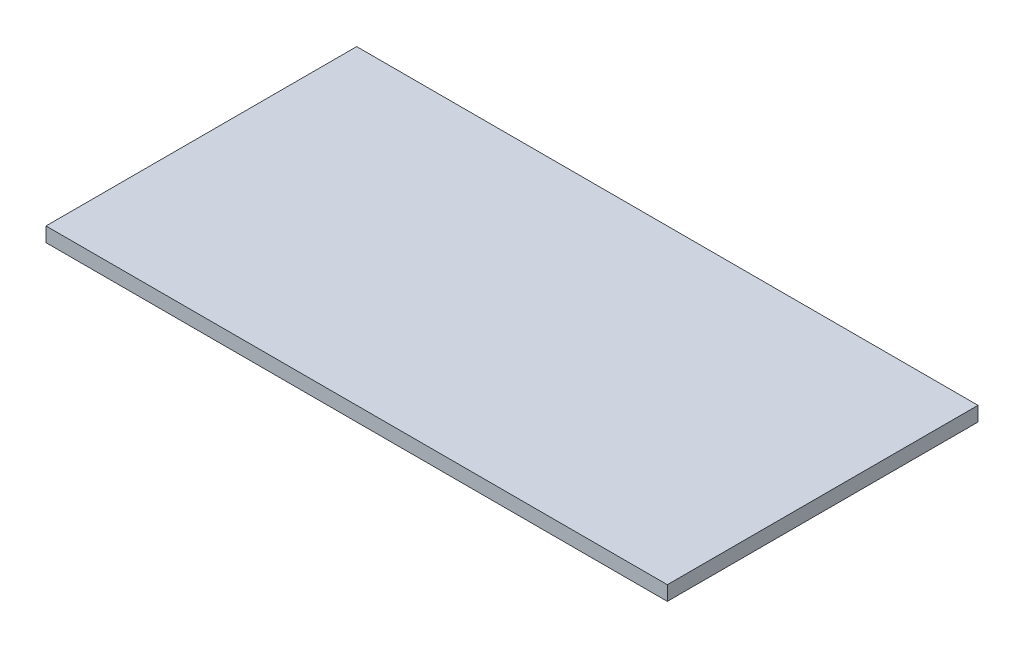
ISO-10303-21;
HEADER;
FILE_DESCRIPTION(('STEP AP214'),'2;1');
FILE_NAME('part.step','',(''),(''),'','','');
FILE_SCHEMA(('AUTOMOTIVE_DESIGN { 1 0 10303 214 1 1 1 1 }'));
ENDSEC;
DATA;
#1=APPLICATION_CONTEXT('core data for automotive mechanical design processes');
#2=APPLICATION_PROTOCOL_DEFINITION('international standard','automotive_design',2000,#1);
#3=PRODUCT_CONTEXT('',#1,'mechanical');
#4=PRODUCT('Part','Part','',(#3));
#5=PRODUCT_RELATED_PRODUCT_CATEGORY('part','',(#4));
#6=PRODUCT_DEFINITION_FORMATION('','',#4);
#7=PRODUCT_DEFINITION_CONTEXT('part definition',#1,'design');
#8=PRODUCT_DEFINITION('design','',#6,#7);
#9=PRODUCT_DEFINITION_SHAPE('','',#8);
#10=(LENGTH_UNIT() NAMED_UNIT(*) SI_UNIT(.MILLI.,.METRE.));
#11=(NAMED_UNIT(*) PLANE_ANGLE_UNIT() SI_UNIT($,.RADIAN.));
#12=(NAMED_UNIT(*) SI_UNIT($,.STERADIAN.) SOLID_ANGLE_UNIT());
#13=UNCERTAINTY_MEASURE_WITH_UNIT(LENGTH_MEASURE(1.E-05),#10,'distance_accuracy_value','');
#14=(GEOMETRIC_REPRESENTATION_CONTEXT(3) GLOBAL_UNCERTAINTY_ASSIGNED_CONTEXT((#13)) GLOBAL_UNIT_ASSIGNED_CONTEXT((#10,
#11,#12)) REPRESENTATION_CONTEXT('',''));
#15=CARTESIAN_POINT('',(0.,0.,0.));
#16=DIRECTION('',(0.,0.,1.));
#17=DIRECTION('',(1.,0.,0.));
#18=AXIS2_PLACEMENT_3D('',#15,#16,#17);
#19=CARTESIAN_POINT('',(560.,0.,-260.));
#20=DIRECTION('',(0.,1.,0.));
#21=DIRECTION('',(0.,0.,-1.));
#22=AXIS2_PLACEMENT_3D('',#19,#20,#21);
#23=CONICAL_SURFACE('',#22,20.,0.78539816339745);
#24=DIRECTION('',(0.,0.707106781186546,-0.707106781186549));
#25=VECTOR('',#24,1.);
#26=CARTESIAN_POINT('',(560.,0.,-280.));
#27=LINE('',#26,#25);
#28=CARTESIAN_POINT('',(560.,-4.41421356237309,-275.585786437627));
#29=VERTEX_POINT('',#28);
#30=CARTESIAN_POINT('',(560.,-0.585786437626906,-279.414213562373));
#31=VERTEX_POINT('',#30);
#32=EDGE_CURVE('E199',#29,#31,#27,.T.);
#33=ORIENTED_EDGE('',*,*,#32,.T.);
#34=CARTESIAN_POINT('',(560.,-0.585786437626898,-260.));
#35=DIRECTION('',(0.,-1.,0.));
#36=DIRECTION('',(0.,0.,-1.));
#37=AXIS2_PLACEMENT_3D('',#34,#35,#36);
#38=CIRCLE('',#37,19.4142135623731);
#39=CARTESIAN_POINT('',(579.414213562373,-0.585786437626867,-260.));
#40=VERTEX_POINT('',#39);
#41=EDGE_CURVE('E265',#31,#40,#38,.T.);
#42=ORIENTED_EDGE('',*,*,#41,.T.);
#43=DIRECTION('',(0.707106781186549,0.707106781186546,0.));
#44=VECTOR('',#43,1.);
#45=CARTESIAN_POINT('',(580.,0.,-260.));
#46=LINE('',#45,#44);
#47=CARTESIAN_POINT('',(575.585786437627,-4.41421356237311,-260.));
#48=VERTEX_POINT('',#47);
#49=EDGE_CURVE('E208',#48,#40,#46,.T.);
#50=ORIENTED_EDGE('',*,*,#49,.F.);
#51=CARTESIAN_POINT('',(560.,-4.4142135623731,-260.));
#52=DIRECTION('',(0.,-1.,0.));
#53=DIRECTION('',(0.,0.,-1.));
#54=AXIS2_PLACEMENT_3D('',#51,#52,#53);
#55=CIRCLE('',#54,15.5857864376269);
#56=EDGE_CURVE('E263',#48,#29,#55,.F.);
#57=ORIENTED_EDGE('',*,*,#56,.T.);
#58=EDGE_LOOP('',(#33,#42,#50,#57));
#59=FACE_BOUND('',#58,.T.);
#60=ADVANCED_FACE('F36',(#59),#23,.T.);
#61=CARTESIAN_POINT('',(580.,0.,-260.));
#62=DIRECTION('',(0.707106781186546,-0.707106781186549,0.));
#63=DIRECTION('',(0.707106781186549,0.707106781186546,0.));
#64=AXIS2_PLACEMENT_3D('',#61,#62,#63);
#65=PLANE('',#64);
#66=ORIENTED_EDGE('',*,*,#49,.T.);
#67=DIRECTION('',(0.,0.,-1.));
#68=VECTOR('',#67,1.);
#69=CARTESIAN_POINT('',(579.414213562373,-0.585786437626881,-260.));
#70=LINE('',#69,#68);
#71=CARTESIAN_POINT('',(579.414213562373,-0.585786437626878,260.));
#72=VERTEX_POINT('',#71);
#73=EDGE_CURVE('E269',#40,#72,#70,.F.);
#74=ORIENTED_EDGE('',*,*,#73,.T.);
#75=DIRECTION('',(0.707106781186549,0.707106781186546,0.));
#76=VECTOR('',#75,1.);
#77=CARTESIAN_POINT('',(580.,0.,260.));
#78=LINE('',#77,#76);
#79=CARTESIAN_POINT('',(575.585786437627,-4.41421356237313,260.));
#80=VERTEX_POINT('',#79);
#81=EDGE_CURVE('E211',#80,#72,#78,.T.);
#82=ORIENTED_EDGE('',*,*,#81,.F.);
#83=DIRECTION('',(0.,0.,-1.));
#84=VECTOR('',#83,1.);
#85=CARTESIAN_POINT('',(575.585786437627,-4.41421356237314,-260.));
#86=LINE('',#85,#84);
#87=EDGE_CURVE('E267',#80,#48,#86,.T.);
#88=ORIENTED_EDGE('',*,*,#87,.T.);
#89=EDGE_LOOP('',(#66,#74,#82,#88));
#90=FACE_BOUND('',#89,.T.);
#91=ADVANCED_FACE('F386',(#90),#65,.T.);
#92=CARTESIAN_POINT('',(560.,0.,260.));
#93=DIRECTION('',(0.,1.,0.));
#94=DIRECTION('',(0.,0.,1.));
#95=AXIS2_PLACEMENT_3D('',#92,#93,#94);
#96=CONICAL_SURFACE('',#95,20.,0.78539816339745);
#97=ORIENTED_EDGE('',*,*,#81,.T.);
#98=CARTESIAN_POINT('',(560.,-0.585786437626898,260.));
#99=DIRECTION('',(0.,-1.,0.));
#100=DIRECTION('',(0.,0.,-1.));
#101=AXIS2_PLACEMENT_3D('',#98,#99,#100);
#102=CIRCLE('',#101,19.4142135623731);
#103=CARTESIAN_POINT('',(560.,-0.585786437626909,279.414213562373));
#104=VERTEX_POINT('',#103);
#105=EDGE_CURVE('E273',#72,#104,#102,.T.);
#106=ORIENTED_EDGE('',*,*,#105,.T.);
#107=DIRECTION('',(0.,0.707106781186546,0.707106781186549));
#108=VECTOR('',#107,1.);
#109=CARTESIAN_POINT('',(560.,0.,280.));
#110=LINE('',#109,#108);
#111=CARTESIAN_POINT('',(560.,-4.41421356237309,275.585786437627));
#112=VERTEX_POINT('',#111);
#113=EDGE_CURVE('E224',#112,#104,#110,.T.);
#114=ORIENTED_EDGE('',*,*,#113,.F.);
#115=CARTESIAN_POINT('',(560.,-4.4142135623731,260.));
#116=DIRECTION('',(0.,-1.,0.));
#117=DIRECTION('',(0.,0.,-1.));
#118=AXIS2_PLACEMENT_3D('',#115,#116,#117);
#119=CIRCLE('',#118,15.5857864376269);
#120=EDGE_CURVE('E271',#112,#80,#119,.F.);
#121=ORIENTED_EDGE('',*,*,#120,.T.);
#122=EDGE_LOOP('',(#97,#106,#114,#121));
#123=FACE_BOUND('',#122,.T.);
#124=ADVANCED_FACE('F390',(#123),#96,.T.);
#125=CARTESIAN_POINT('',(-560.,0.,280.));
#126=DIRECTION('',(0.,-0.707106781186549,0.707106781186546));
#127=DIRECTION('',(0.,-0.707106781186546,-0.707106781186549));
#128=AXIS2_PLACEMENT_3D('',#125,#126,#127);
#129=PLANE('',#128);
#130=DIRECTION('',(0.,0.707106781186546,0.707106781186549));
#131=VECTOR('',#130,1.);
#132=CARTESIAN_POINT('',(-560.,0.,280.));
#133=LINE('',#132,#131);
#134=CARTESIAN_POINT('',(-560.,-4.41421356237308,275.585786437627));
#135=VERTEX_POINT('',#134);
#136=CARTESIAN_POINT('',(-560.,-0.585786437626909,279.414213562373));
#137=VERTEX_POINT('',#136);
#138=EDGE_CURVE('E221',#135,#137,#133,.T.);
#139=ORIENTED_EDGE('',*,*,#138,.F.);
#140=DIRECTION('',(1.,0.,0.));
#141=VECTOR('',#140,1.);
#142=CARTESIAN_POINT('',(-560.,-4.41421356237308,275.585786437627));
#143=LINE('',#142,#141);
#144=EDGE_CURVE('E12',#135,#112,#143,.T.);
#145=ORIENTED_EDGE('',*,*,#144,.T.);
#146=ORIENTED_EDGE('',*,*,#113,.T.);
#147=DIRECTION('',(1.,0.,0.));
#148=VECTOR('',#147,1.);
#149=CARTESIAN_POINT('',(-560.,-0.585786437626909,279.414213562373));
#150=LINE('',#149,#148);
#151=EDGE_CURVE('E45',#104,#137,#150,.F.);
#152=ORIENTED_EDGE('',*,*,#151,.T.);
#153=EDGE_LOOP('',(#139,#145,#146,#152));
#154=FACE_BOUND('',#153,.T.);
#155=ADVANCED_FACE('F406',(#154),#129,.T.);
#156=CARTESIAN_POINT('',(-560.,0.,260.));
#157=DIRECTION('',(0.,1.,0.));
#158=DIRECTION('',(0.,0.,1.));
#159=AXIS2_PLACEMENT_3D('',#156,#157,#158);
#160=CONICAL_SURFACE('',#159,20.,0.78539816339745);
#161=ORIENTED_EDGE('',*,*,#138,.T.);
#162=CARTESIAN_POINT('',(-560.,-0.585786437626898,260.));
#163=DIRECTION('',(0.,-1.,0.));
#164=DIRECTION('',(0.,0.,-1.));
#165=AXIS2_PLACEMENT_3D('',#162,#163,#164);
#166=CIRCLE('',#165,19.4142135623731);
#167=CARTESIAN_POINT('',(-579.414213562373,-0.585786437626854,260.));
#168=VERTEX_POINT('',#167);
#169=EDGE_CURVE('E247',#137,#168,#166,.T.);
#170=ORIENTED_EDGE('',*,*,#169,.T.);
#171=DIRECTION('',(-0.707106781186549,0.707106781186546,0.));
#172=VECTOR('',#171,1.);
#173=CARTESIAN_POINT('',(-580.,0.,260.));
#174=LINE('',#173,#172);
#175=CARTESIAN_POINT('',(-575.585786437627,-4.41421356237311,260.));
#176=VERTEX_POINT('',#175);
#177=EDGE_CURVE('E218',#176,#168,#174,.T.);
#178=ORIENTED_EDGE('',*,*,#177,.F.);
#179=CARTESIAN_POINT('',(-560.,-4.4142135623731,260.));
#180=DIRECTION('',(0.,-1.,0.));
#181=DIRECTION('',(0.,0.,-1.));
#182=AXIS2_PLACEMENT_3D('',#179,#180,#181);
#183=CIRCLE('',#182,15.5857864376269);
#184=EDGE_CURVE('E245',#176,#135,#183,.F.);
#185=ORIENTED_EDGE('',*,*,#184,.T.);
#186=EDGE_LOOP('',(#161,#170,#178,#185));
#187=FACE_BOUND('',#186,.T.);
#188=ADVANCED_FACE('F409',(#187),#160,.T.);
#189=CARTESIAN_POINT('',(-580.,0.,-260.));
#190=DIRECTION('',(-0.707106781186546,-0.707106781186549,0.));
#191=DIRECTION('',(0.707106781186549,-0.707106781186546,0.));
#192=AXIS2_PLACEMENT_3D('',#189,#190,#191);
#193=PLANE('',#192);
#194=ORIENTED_EDGE('',*,*,#177,.T.);
#195=DIRECTION('',(0.,0.,1.));
#196=VECTOR('',#195,1.);
#197=CARTESIAN_POINT('',(-579.414213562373,-0.585786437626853,-260.));
#198=LINE('',#197,#196);
#199=CARTESIAN_POINT('',(-579.414213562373,-0.585786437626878,-260.));
#200=VERTEX_POINT('',#199);
#201=EDGE_CURVE('E252',#168,#200,#198,.F.);
#202=ORIENTED_EDGE('',*,*,#201,.T.);
#203=DIRECTION('',(-0.707106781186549,0.707106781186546,0.));
#204=VECTOR('',#203,1.);
#205=CARTESIAN_POINT('',(-580.,0.,-260.));
#206=LINE('',#205,#204);
#207=CARTESIAN_POINT('',(-575.585786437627,-4.41421356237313,-260.));
#208=VERTEX_POINT('',#207);
#209=EDGE_CURVE('E215',#208,#200,#206,.T.);
#210=ORIENTED_EDGE('',*,*,#209,.F.);
#211=DIRECTION('',(0.,0.,1.));
#212=VECTOR('',#211,1.);
#213=CARTESIAN_POINT('',(-575.585786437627,-4.41421356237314,-260.));
#214=LINE('',#213,#212);
#215=EDGE_CURVE('E250',#208,#176,#214,.T.);
#216=ORIENTED_EDGE('',*,*,#215,.T.);
#217=EDGE_LOOP('',(#194,#202,#210,#216));
#218=FACE_BOUND('',#217,.T.);
#219=ADVANCED_FACE('F419',(#218),#193,.T.);
#220=CARTESIAN_POINT('',(-560.,0.,-260.));
#221=DIRECTION('',(0.,1.,0.));
#222=DIRECTION('',(0.,0.,1.));
#223=AXIS2_PLACEMENT_3D('',#220,#221,#222);
#224=CONICAL_SURFACE('',#223,20.,0.78539816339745);
#225=ORIENTED_EDGE('',*,*,#209,.T.);
#226=CARTESIAN_POINT('',(-560.,-0.585786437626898,-260.));
#227=DIRECTION('',(0.,-1.,0.));
#228=DIRECTION('',(0.,0.,-1.));
#229=AXIS2_PLACEMENT_3D('',#226,#227,#228);
#230=CIRCLE('',#229,19.4142135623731);
#231=CARTESIAN_POINT('',(-560.,-0.58578643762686,-279.414213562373));
#232=VERTEX_POINT('',#231);
#233=EDGE_CURVE('E256',#200,#232,#230,.T.);
#234=ORIENTED_EDGE('',*,*,#233,.T.);
#235=DIRECTION('',(0.,0.707106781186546,-0.707106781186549));
#236=VECTOR('',#235,1.);
#237=CARTESIAN_POINT('',(-560.,0.,-280.));
#238=LINE('',#237,#236);
#239=CARTESIAN_POINT('',(-560.,-4.41421356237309,-275.585786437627));
#240=VERTEX_POINT('',#239);
#241=EDGE_CURVE('E202',#240,#232,#238,.T.);
#242=ORIENTED_EDGE('',*,*,#241,.F.);
#243=CARTESIAN_POINT('',(-560.,-4.4142135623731,-260.));
#244=DIRECTION('',(0.,-1.,0.));
#245=DIRECTION('',(0.,0.,-1.));
#246=AXIS2_PLACEMENT_3D('',#243,#244,#245);
#247=CIRCLE('',#246,15.5857864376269);
#248=EDGE_CURVE('E254',#240,#208,#247,.F.);
#249=ORIENTED_EDGE('',*,*,#248,.T.);
#250=EDGE_LOOP('',(#225,#234,#242,#249));
#251=FACE_BOUND('',#250,.T.);
#252=ADVANCED_FACE('F422',(#251),#224,.T.);
#253=CARTESIAN_POINT('',(-560.,0.,-280.));
#254=DIRECTION('',(0.,-0.707106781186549,-0.707106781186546));
#255=DIRECTION('',(0.,0.707106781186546,-0.707106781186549));
#256=AXIS2_PLACEMENT_3D('',#253,#254,#255);
#257=PLANE('',#256);
#258=ORIENTED_EDGE('',*,*,#241,.T.);
#259=DIRECTION('',(-1.,0.,0.));
#260=VECTOR('',#259,1.);
#261=CARTESIAN_POINT('',(-560.,-0.585786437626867,-279.414213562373));
#262=LINE('',#261,#260);
#263=EDGE_CURVE('E261',#232,#31,#262,.F.);
#264=ORIENTED_EDGE('',*,*,#263,.T.);
#265=ORIENTED_EDGE('',*,*,#32,.F.);
#266=DIRECTION('',(-1.,0.,0.));
#267=VECTOR('',#266,1.);
#268=CARTESIAN_POINT('',(-560.,-4.41421356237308,-275.585786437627));
#269=LINE('',#268,#267);
#270=EDGE_CURVE('E258',#29,#240,#269,.T.);
#271=ORIENTED_EDGE('',*,*,#270,.T.);
#272=EDGE_LOOP('',(#258,#264,#265,#271));
#273=FACE_BOUND('',#272,.T.);
#274=ADVANCED_FACE('F361',(#273),#257,.T.);
#275=CARTESIAN_POINT('',(560.,-5.,-260.));
#276=DIRECTION('',(0.,-1.,0.));
#277=DIRECTION('',(0.,0.,-1.));
#278=AXIS2_PLACEMENT_3D('',#275,#276,#277);
#279=PLANE('',#278);
#280=CARTESIAN_POINT('',(-560.,-5.,-260.));
#281=DIRECTION('',(0.,-1.,0.));
#282=DIRECTION('',(0.,0.,-1.));
#283=AXIS2_PLACEMENT_3D('',#280,#281,#282);
#284=CIRCLE('',#283,14.1715728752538);
#285=CARTESIAN_POINT('',(-574.171572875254,-5.,-260.));
#286=VERTEX_POINT('',#285);
#287=CARTESIAN_POINT('',(-560.,-5.,-274.171572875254));
#288=VERTEX_POINT('',#287);
#289=EDGE_CURVE('E53',#286,#288,#284,.T.);
#290=ORIENTED_EDGE('',*,*,#289,.T.);
#291=DIRECTION('',(-1.,0.,0.));
#292=VECTOR('',#291,1.);
#293=CARTESIAN_POINT('',(560.,-5.,-274.171572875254));
#294=LINE('',#293,#292);
#295=CARTESIAN_POINT('',(560.,-5.,-274.171572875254));
#296=VERTEX_POINT('',#295);
#297=EDGE_CURVE('E287',#288,#296,#294,.F.);
#298=ORIENTED_EDGE('',*,*,#297,.T.);
#299=CARTESIAN_POINT('',(560.,-5.,-260.));
#300=DIRECTION('',(0.,-1.,0.));
#301=DIRECTION('',(0.,0.,-1.));
#302=AXIS2_PLACEMENT_3D('',#299,#300,#301);
#303=CIRCLE('',#302,14.1715728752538);
#304=CARTESIAN_POINT('',(574.171572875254,-5.,-260.));
#305=VERTEX_POINT('',#304);
#306=EDGE_CURVE('E275',#296,#305,#303,.T.);
#307=ORIENTED_EDGE('',*,*,#306,.T.);
#308=DIRECTION('',(0.,0.,-1.));
#309=VECTOR('',#308,1.);
#310=CARTESIAN_POINT('',(574.171572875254,-5.,-260.));
#311=LINE('',#310,#309);
#312=CARTESIAN_POINT('',(574.171572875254,-5.,260.));
#313=VERTEX_POINT('',#312);
#314=EDGE_CURVE('E277',#305,#313,#311,.F.);
#315=ORIENTED_EDGE('',*,*,#314,.T.);
#316=CARTESIAN_POINT('',(560.,-5.,260.));
#317=DIRECTION('',(0.,-1.,0.));
#318=DIRECTION('',(0.,0.,-1.));
#319=AXIS2_PLACEMENT_3D('',#316,#317,#318);
#320=CIRCLE('',#319,14.1715728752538);
#321=CARTESIAN_POINT('',(560.,-5.,274.171572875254));
#322=VERTEX_POINT('',#321);
#323=EDGE_CURVE('E279',#313,#322,#320,.T.);
#324=ORIENTED_EDGE('',*,*,#323,.T.);
#325=DIRECTION('',(1.,0.,0.));
#326=VECTOR('',#325,1.);
#327=CARTESIAN_POINT('',(560.,-5.,274.171572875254));
#328=LINE('',#327,#326);
#329=CARTESIAN_POINT('',(-560.,-5.,274.171572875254));
#330=VERTEX_POINT('',#329);
#331=EDGE_CURVE('E281',#322,#330,#328,.F.);
#332=ORIENTED_EDGE('',*,*,#331,.T.);
#333=CARTESIAN_POINT('',(-560.,-5.,260.));
#334=DIRECTION('',(0.,-1.,0.));
#335=DIRECTION('',(0.,0.,-1.));
#336=AXIS2_PLACEMENT_3D('',#333,#334,#335);
#337=CIRCLE('',#336,14.1715728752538);
#338=CARTESIAN_POINT('',(-574.171572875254,-5.,260.));
#339=VERTEX_POINT('',#338);
#340=EDGE_CURVE('E283',#330,#339,#337,.T.);
#341=ORIENTED_EDGE('',*,*,#340,.T.);
#342=DIRECTION('',(0.,0.,1.));
#343=VECTOR('',#342,1.);
#344=CARTESIAN_POINT('',(-574.171572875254,-5.,-260.));
#345=LINE('',#344,#343);
#346=EDGE_CURVE('E58',#339,#286,#345,.F.);
#347=ORIENTED_EDGE('',*,*,#346,.T.);
#348=EDGE_LOOP('',(#290,#298,#307,#315,#324,#332,#341,#347));
#349=FACE_BOUND('',#348,.T.);
#350=ADVANCED_FACE('F343',(#349),#279,.T.);
#351=CARTESIAN_POINT('',(600.,28.,-300.));
#352=DIRECTION('',(-1.,0.,0.));
#353=DIRECTION('',(0.,0.,1.));
#354=AXIS2_PLACEMENT_3D('',#351,#352,#353);
#355=PLANE('',#354);
#356=DIRECTION('',(0.,0.,-1.));
#357=VECTOR('',#356,1.);
#358=CARTESIAN_POINT('',(600.,0.,-300.));
#359=LINE('',#358,#357);
#360=CARTESIAN_POINT('',(600.,0.,300.));
#361=VERTEX_POINT('',#360);
#362=CARTESIAN_POINT('',(600.,0.,-300.));
#363=VERTEX_POINT('',#362);
#364=EDGE_CURVE('E198',#361,#363,#359,.T.);
#365=ORIENTED_EDGE('',*,*,#364,.T.);
#366=DIRECTION('',(0.,-1.,0.));
#367=VECTOR('',#366,1.);
#368=CARTESIAN_POINT('',(600.,28.,-300.));
#369=LINE('',#368,#367);
#370=CARTESIAN_POINT('',(600.,28.,-300.));
#371=VERTEX_POINT('',#370);
#372=EDGE_CURVE('E178',#371,#363,#369,.T.);
#373=ORIENTED_EDGE('',*,*,#372,.F.);
#374=DIRECTION('',(0.,0.,-1.));
#375=VECTOR('',#374,1.);
#376=CARTESIAN_POINT('',(600.,28.,-300.));
#377=LINE('',#376,#375);
#378=CARTESIAN_POINT('',(600.,28.,300.));
#379=VERTEX_POINT('',#378);
#380=EDGE_CURVE('E185',#379,#371,#377,.T.);
#381=ORIENTED_EDGE('',*,*,#380,.F.);
#382=DIRECTION('',(0.,-1.,0.));
#383=VECTOR('',#382,1.);
#384=CARTESIAN_POINT('',(600.,28.,300.));
#385=LINE('',#384,#383);
#386=EDGE_CURVE('E746',#379,#361,#385,.T.);
#387=ORIENTED_EDGE('',*,*,#386,.T.);
#388=EDGE_LOOP('',(#365,#373,#381,#387));
#389=FACE_BOUND('',#388,.T.);
#390=ADVANCED_FACE('F196',(#389),#355,.F.);
#391=CARTESIAN_POINT('',(-600.,28.,-300.));
#392=DIRECTION('',(0.,0.,1.));
#393=DIRECTION('',(1.,0.,0.));
#394=AXIS2_PLACEMENT_3D('',#391,#392,#393);
#395=PLANE('',#394);
#396=DIRECTION('',(-1.,0.,0.));
#397=VECTOR('',#396,1.);
#398=CARTESIAN_POINT('',(-600.,0.,-300.));
#399=LINE('',#398,#397);
#400=CARTESIAN_POINT('',(-600.,0.,-300.));
#401=VERTEX_POINT('',#400);
#402=EDGE_CURVE('E752',#363,#401,#399,.T.);
#403=ORIENTED_EDGE('',*,*,#402,.T.);
#404=DIRECTION('',(0.,-1.,0.));
#405=VECTOR('',#404,1.);
#406=CARTESIAN_POINT('',(-600.,28.,-300.));
#407=LINE('',#406,#405);
#408=CARTESIAN_POINT('',(-600.,28.,-300.));
#409=VERTEX_POINT('',#408);
#410=EDGE_CURVE('E181',#409,#401,#407,.T.);
#411=ORIENTED_EDGE('',*,*,#410,.F.);
#412=DIRECTION('',(-1.,0.,0.));
#413=VECTOR('',#412,1.);
#414=CARTESIAN_POINT('',(-600.,28.,-300.));
#415=LINE('',#414,#413);
#416=EDGE_CURVE('E174',#371,#409,#415,.T.);
#417=ORIENTED_EDGE('',*,*,#416,.F.);
#418=ORIENTED_EDGE('',*,*,#372,.T.);
#419=EDGE_LOOP('',(#403,#411,#417,#418));
#420=FACE_BOUND('',#419,.T.);
#421=ADVANCED_FACE('F176',(#420),#395,.F.);
#422=CARTESIAN_POINT('',(-600.,28.,-300.));
#423=DIRECTION('',(1.,0.,0.));
#424=DIRECTION('',(0.,0.,-1.));
#425=AXIS2_PLACEMENT_3D('',#422,#423,#424);
#426=PLANE('',#425);
#427=DIRECTION('',(0.,0.,1.));
#428=VECTOR('',#427,1.);
#429=CARTESIAN_POINT('',(-600.,0.,-300.));
#430=LINE('',#429,#428);
#431=CARTESIAN_POINT('',(-600.,0.,300.));
#432=VERTEX_POINT('',#431);
#433=EDGE_CURVE('E749',#401,#432,#430,.T.);
#434=ORIENTED_EDGE('',*,*,#433,.T.);
#435=DIRECTION('',(0.,-1.,0.));
#436=VECTOR('',#435,1.);
#437=CARTESIAN_POINT('',(-600.,28.,300.));
#438=LINE('',#437,#436);
#439=CARTESIAN_POINT('',(-600.,28.,300.));
#440=VERTEX_POINT('',#439);
#441=EDGE_CURVE('E204',#440,#432,#438,.T.);
#442=ORIENTED_EDGE('',*,*,#441,.F.);
#443=DIRECTION('',(0.,0.,1.));
#444=VECTOR('',#443,1.);
#445=CARTESIAN_POINT('',(-600.,28.,-300.));
#446=LINE('',#445,#444);
#447=EDGE_CURVE('E184',#409,#440,#446,.T.);
#448=ORIENTED_EDGE('',*,*,#447,.F.);
#449=ORIENTED_EDGE('',*,*,#410,.T.);
#450=EDGE_LOOP('',(#434,#442,#448,#449));
#451=FACE_BOUND('',#450,.T.);
#452=ADVANCED_FACE('F516',(#451),#426,.F.);
#453=CARTESIAN_POINT('',(-600.,28.,300.));
#454=DIRECTION('',(0.,0.,-1.));
#455=DIRECTION('',(-1.,0.,0.));
#456=AXIS2_PLACEMENT_3D('',#453,#454,#455);
#457=PLANE('',#456);
#458=DIRECTION('',(1.,0.,0.));
#459=VECTOR('',#458,1.);
#460=CARTESIAN_POINT('',(-600.,0.,300.));
#461=LINE('',#460,#459);
#462=EDGE_CURVE('E194',#432,#361,#461,.T.);
#463=ORIENTED_EDGE('',*,*,#462,.T.);
#464=ORIENTED_EDGE('',*,*,#386,.F.);
#465=DIRECTION('',(1.,0.,0.));
#466=VECTOR('',#465,1.);
#467=CARTESIAN_POINT('',(-600.,28.,300.));
#468=LINE('',#467,#466);
#469=EDGE_CURVE('E190',#440,#379,#468,.T.);
#470=ORIENTED_EDGE('',*,*,#469,.F.);
#471=ORIENTED_EDGE('',*,*,#441,.T.);
#472=EDGE_LOOP('',(#463,#464,#470,#471));
#473=FACE_BOUND('',#472,.T.);
#474=ADVANCED_FACE('F525',(#473),#457,.F.);
#475=CARTESIAN_POINT('',(0.,28.,0.));
#476=DIRECTION('',(0.,1.,0.));
#477=DIRECTION('',(0.,0.,1.));
#478=AXIS2_PLACEMENT_3D('',#475,#476,#477);
#479=PLANE('',#478);
#480=ORIENTED_EDGE('',*,*,#380,.T.);
#481=ORIENTED_EDGE('',*,*,#416,.T.);
#482=ORIENTED_EDGE('',*,*,#447,.T.);
#483=ORIENTED_EDGE('',*,*,#469,.T.);
#484=EDGE_LOOP('',(#480,#481,#482,#483));
#485=FACE_BOUND('',#484,.T.);
#486=ADVANCED_FACE('F188',(#485),#479,.T.);
#487=CARTESIAN_POINT('',(0.,0.,0.));
#488=DIRECTION('',(0.,1.,0.));
#489=DIRECTION('',(0.,0.,1.));
#490=AXIS2_PLACEMENT_3D('',#487,#488,#489);
#491=PLANE('',#490);
#492=DIRECTION('',(0.,0.,1.));
#493=VECTOR('',#492,1.);
#494=CARTESIAN_POINT('',(-580.828427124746,0.,0.));
#495=LINE('',#494,#493);
#496=CARTESIAN_POINT('',(-580.828427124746,0.,-260.));
#497=VERTEX_POINT('',#496);
#498=CARTESIAN_POINT('',(-580.828427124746,0.,260.));
#499=VERTEX_POINT('',#498);
#500=EDGE_CURVE('E240',#497,#499,#495,.T.);
#501=ORIENTED_EDGE('',*,*,#500,.T.);
#502=CARTESIAN_POINT('',(-560.,0.,260.));
#503=DIRECTION('',(0.,1.,0.));
#504=DIRECTION('',(0.,0.,1.));
#505=AXIS2_PLACEMENT_3D('',#502,#503,#504);
#506=CIRCLE('',#505,20.8284271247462);
#507=CARTESIAN_POINT('',(-560.,0.,280.828427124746));
#508=VERTEX_POINT('',#507);
#509=EDGE_CURVE('E242',#499,#508,#506,.T.);
#510=ORIENTED_EDGE('',*,*,#509,.T.);
#511=DIRECTION('',(1.,0.,0.));
#512=VECTOR('',#511,1.);
#513=CARTESIAN_POINT('',(0.,0.,280.828427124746));
#514=LINE('',#513,#512);
#515=CARTESIAN_POINT('',(560.,0.,280.828427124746));
#516=VERTEX_POINT('',#515);
#517=EDGE_CURVE('E210',#508,#516,#514,.T.);
#518=ORIENTED_EDGE('',*,*,#517,.T.);
#519=CARTESIAN_POINT('',(560.,0.,260.));
#520=DIRECTION('',(0.,1.,0.));
#521=DIRECTION('',(0.,0.,1.));
#522=AXIS2_PLACEMENT_3D('',#519,#520,#521);
#523=CIRCLE('',#522,20.8284271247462);
#524=CARTESIAN_POINT('',(580.828427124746,0.,260.));
#525=VERTEX_POINT('',#524);
#526=EDGE_CURVE('E230',#516,#525,#523,.T.);
#527=ORIENTED_EDGE('',*,*,#526,.T.);
#528=DIRECTION('',(0.,0.,-1.));
#529=VECTOR('',#528,1.);
#530=CARTESIAN_POINT('',(580.828427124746,0.,0.));
#531=LINE('',#530,#529);
#532=CARTESIAN_POINT('',(580.828427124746,0.,-260.));
#533=VERTEX_POINT('',#532);
#534=EDGE_CURVE('E232',#525,#533,#531,.T.);
#535=ORIENTED_EDGE('',*,*,#534,.T.);
#536=CARTESIAN_POINT('',(560.,0.,-260.));
#537=DIRECTION('',(0.,1.,0.));
#538=DIRECTION('',(0.,0.,1.));
#539=AXIS2_PLACEMENT_3D('',#536,#537,#538);
#540=CIRCLE('',#539,20.8284271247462);
#541=CARTESIAN_POINT('',(560.,0.,-280.828427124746));
#542=VERTEX_POINT('',#541);
#543=EDGE_CURVE('E234',#533,#542,#540,.T.);
#544=ORIENTED_EDGE('',*,*,#543,.T.);
#545=DIRECTION('',(-1.,0.,0.));
#546=VECTOR('',#545,1.);
#547=CARTESIAN_POINT('',(0.,0.,-280.828427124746));
#548=LINE('',#547,#546);
#549=CARTESIAN_POINT('',(-560.,0.,-280.828427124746));
#550=VERTEX_POINT('',#549);
#551=EDGE_CURVE('E236',#542,#550,#548,.T.);
#552=ORIENTED_EDGE('',*,*,#551,.T.);
#553=CARTESIAN_POINT('',(-560.,0.,-260.));
#554=DIRECTION('',(0.,1.,0.));
#555=DIRECTION('',(0.,0.,1.));
#556=AXIS2_PLACEMENT_3D('',#553,#554,#555);
#557=CIRCLE('',#556,20.8284271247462);
#558=EDGE_CURVE('E238',#550,#497,#557,.T.);
#559=ORIENTED_EDGE('',*,*,#558,.T.);
#560=EDGE_LOOP('',(#501,#510,#518,#527,#535,#544,#552,#559));
#561=FACE_BOUND('',#560,.T.);
#562=ORIENTED_EDGE('',*,*,#364,.F.);
#563=ORIENTED_EDGE('',*,*,#462,.F.);
#564=ORIENTED_EDGE('',*,*,#433,.F.);
#565=ORIENTED_EDGE('',*,*,#402,.F.);
#566=EDGE_LOOP('',(#562,#563,#564,#565));
#567=FACE_BOUND('',#566,.T.);
#568=ADVANCED_FACE('F376',(#561,#567),#491,.F.);
#569=CARTESIAN_POINT('',(560.,-2.,-260.));
#570=DIRECTION('',(0.,1.,0.));
#571=DIRECTION('',(0.,0.,1.));
#572=AXIS2_PLACEMENT_3D('',#569,#570,#571);
#573=TOROIDAL_SURFACE('',#572,20.8284271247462,2.);
#574=CARTESIAN_POINT('',(580.828427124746,-2.,-260.));
#575=DIRECTION('',(0.,0.,-1.));
#576=DIRECTION('',(-1.,0.,0.));
#577=AXIS2_PLACEMENT_3D('',#574,#575,#576);
#578=CIRCLE('',#577,2.);
#579=EDGE_CURVE('E306',#40,#533,#578,.T.);
#580=ORIENTED_EDGE('',*,*,#579,.F.);
#581=ORIENTED_EDGE('',*,*,#41,.F.);
#582=CARTESIAN_POINT('',(560.,-2.,-280.828427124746));
#583=DIRECTION('',(1.,0.,0.));
#584=DIRECTION('',(0.,0.,-1.));
#585=AXIS2_PLACEMENT_3D('',#582,#583,#584);
#586=CIRCLE('',#585,2.);
#587=EDGE_CURVE('E309',#542,#31,#586,.T.);
#588=ORIENTED_EDGE('',*,*,#587,.F.);
#589=ORIENTED_EDGE('',*,*,#543,.F.);
#590=EDGE_LOOP('',(#580,#581,#588,#589));
#591=FACE_BOUND('',#590,.T.);
#592=ADVANCED_FACE('F383',(#591),#573,.F.);
#593=CARTESIAN_POINT('',(0.,-2.,-280.828427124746));
#594=DIRECTION('',(-1.,0.,0.));
#595=DIRECTION('',(0.,0.,1.));
#596=AXIS2_PLACEMENT_3D('',#593,#594,#595);
#597=CYLINDRICAL_SURFACE('',#596,2.);
#598=ORIENTED_EDGE('',*,*,#587,.T.);
#599=ORIENTED_EDGE('',*,*,#263,.F.);
#600=CARTESIAN_POINT('',(-560.,-2.,-280.828427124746));
#601=DIRECTION('',(1.,0.,0.));
#602=DIRECTION('',(0.,0.,-1.));
#603=AXIS2_PLACEMENT_3D('',#600,#601,#602);
#604=CIRCLE('',#603,2.);
#605=EDGE_CURVE('E303',#550,#232,#604,.T.);
#606=ORIENTED_EDGE('',*,*,#605,.F.);
#607=ORIENTED_EDGE('',*,*,#551,.F.);
#608=EDGE_LOOP('',(#598,#599,#606,#607));
#609=FACE_BOUND('',#608,.T.);
#610=ADVANCED_FACE('F366',(#609),#597,.F.);
#611=CARTESIAN_POINT('',(580.828427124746,-2.,0.));
#612=DIRECTION('',(0.,0.,-1.));
#613=DIRECTION('',(-1.,0.,0.));
#614=AXIS2_PLACEMENT_3D('',#611,#612,#613);
#615=CYLINDRICAL_SURFACE('',#614,2.);
#616=ORIENTED_EDGE('',*,*,#579,.T.);
#617=ORIENTED_EDGE('',*,*,#534,.F.);
#618=CARTESIAN_POINT('',(580.828427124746,-1.99999999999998,260.));
#619=DIRECTION('',(0.,0.,-1.));
#620=DIRECTION('',(-1.,0.,0.));
#621=AXIS2_PLACEMENT_3D('',#618,#619,#620);
#622=CIRCLE('',#621,2.);
#623=EDGE_CURVE('E300',#72,#525,#622,.T.);
#624=ORIENTED_EDGE('',*,*,#623,.F.);
#625=ORIENTED_EDGE('',*,*,#73,.F.);
#626=EDGE_LOOP('',(#616,#617,#624,#625));
#627=FACE_BOUND('',#626,.T.);
#628=ADVANCED_FACE('F394',(#627),#615,.F.);
#629=CARTESIAN_POINT('',(-560.,-2.,-260.));
#630=DIRECTION('',(0.,1.,0.));
#631=DIRECTION('',(0.,0.,1.));
#632=AXIS2_PLACEMENT_3D('',#629,#630,#631);
#633=TOROIDAL_SURFACE('',#632,20.8284271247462,2.);
#634=ORIENTED_EDGE('',*,*,#605,.T.);
#635=ORIENTED_EDGE('',*,*,#233,.F.);
#636=CARTESIAN_POINT('',(-580.828427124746,-2.,-260.));
#637=DIRECTION('',(0.,0.,-1.));
#638=DIRECTION('',(-1.,0.,0.));
#639=AXIS2_PLACEMENT_3D('',#636,#637,#638);
#640=CIRCLE('',#639,2.);
#641=EDGE_CURVE('E297',#497,#200,#640,.T.);
#642=ORIENTED_EDGE('',*,*,#641,.F.);
#643=ORIENTED_EDGE('',*,*,#558,.F.);
#644=EDGE_LOOP('',(#634,#635,#642,#643));
#645=FACE_BOUND('',#644,.T.);
#646=ADVANCED_FACE('F372',(#645),#633,.F.);
#647=CARTESIAN_POINT('',(560.,-2.,260.));
#648=DIRECTION('',(0.,1.,0.));
#649=DIRECTION('',(0.,0.,1.));
#650=AXIS2_PLACEMENT_3D('',#647,#648,#649);
#651=TOROIDAL_SURFACE('',#650,20.8284271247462,2.);
#652=ORIENTED_EDGE('',*,*,#623,.T.);
#653=ORIENTED_EDGE('',*,*,#526,.F.);
#654=CARTESIAN_POINT('',(560.,-2.,280.828427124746));
#655=DIRECTION('',(1.,0.,0.));
#656=DIRECTION('',(0.,0.,-1.));
#657=AXIS2_PLACEMENT_3D('',#654,#655,#656);
#658=CIRCLE('',#657,2.);
#659=EDGE_CURVE('E294',#104,#516,#658,.T.);
#660=ORIENTED_EDGE('',*,*,#659,.F.);
#661=ORIENTED_EDGE('',*,*,#105,.F.);
#662=EDGE_LOOP('',(#652,#653,#660,#661));
#663=FACE_BOUND('',#662,.T.);
#664=ADVANCED_FACE('F398',(#663),#651,.F.);
#665=CARTESIAN_POINT('',(-580.828427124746,-2.,0.));
#666=DIRECTION('',(0.,0.,1.));
#667=DIRECTION('',(1.,0.,0.));
#668=AXIS2_PLACEMENT_3D('',#665,#666,#667);
#669=CYLINDRICAL_SURFACE('',#668,2.);
#670=ORIENTED_EDGE('',*,*,#641,.T.);
#671=ORIENTED_EDGE('',*,*,#201,.F.);
#672=CARTESIAN_POINT('',(-580.828427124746,-2.,260.));
#673=DIRECTION('',(0.,0.,-1.));
#674=DIRECTION('',(-1.,0.,0.));
#675=AXIS2_PLACEMENT_3D('',#672,#673,#674);
#676=CIRCLE('',#675,2.);
#677=EDGE_CURVE('E292',#499,#168,#676,.T.);
#678=ORIENTED_EDGE('',*,*,#677,.F.);
#679=ORIENTED_EDGE('',*,*,#500,.F.);
#680=EDGE_LOOP('',(#670,#671,#678,#679));
#681=FACE_BOUND('',#680,.T.);
#682=ADVANCED_FACE('F416',(#681),#669,.F.);
#683=CARTESIAN_POINT('',(0.,-2.,280.828427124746));
#684=DIRECTION('',(1.,0.,0.));
#685=DIRECTION('',(0.,0.,-1.));
#686=AXIS2_PLACEMENT_3D('',#683,#684,#685);
#687=CYLINDRICAL_SURFACE('',#686,2.);
#688=ORIENTED_EDGE('',*,*,#659,.T.);
#689=ORIENTED_EDGE('',*,*,#517,.F.);
#690=CARTESIAN_POINT('',(-560.,-2.00000000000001,280.828427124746));
#691=DIRECTION('',(1.,0.,0.));
#692=DIRECTION('',(0.,0.,-1.));
#693=AXIS2_PLACEMENT_3D('',#690,#691,#692);
#694=CIRCLE('',#693,2.);
#695=EDGE_CURVE('E290',#137,#508,#694,.T.);
#696=ORIENTED_EDGE('',*,*,#695,.F.);
#697=ORIENTED_EDGE('',*,*,#151,.F.);
#698=EDGE_LOOP('',(#688,#689,#696,#697));
#699=FACE_BOUND('',#698,.T.);
#700=ADVANCED_FACE('F403',(#699),#687,.F.);
#701=CARTESIAN_POINT('',(-560.,-2.,260.));
#702=DIRECTION('',(0.,1.,0.));
#703=DIRECTION('',(0.,0.,1.));
#704=AXIS2_PLACEMENT_3D('',#701,#702,#703);
#705=TOROIDAL_SURFACE('',#704,20.8284271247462,2.);
#706=ORIENTED_EDGE('',*,*,#677,.T.);
#707=ORIENTED_EDGE('',*,*,#169,.F.);
#708=ORIENTED_EDGE('',*,*,#695,.T.);
#709=ORIENTED_EDGE('',*,*,#509,.F.);
#710=EDGE_LOOP('',(#706,#707,#708,#709));
#711=FACE_BOUND('',#710,.T.);
#712=ADVANCED_FACE('F412',(#711),#705,.F.);
#713=CARTESIAN_POINT('',(-560.,-3.,274.171572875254));
#714=DIRECTION('',(1.,0.,0.));
#715=DIRECTION('',(0.,0.,-1.));
#716=AXIS2_PLACEMENT_3D('',#713,#714,#715);
#717=CYLINDRICAL_SURFACE('',#716,2.);
#718=CARTESIAN_POINT('',(-560.,-3.,274.171572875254));
#719=DIRECTION('',(-1.,0.,0.));
#720=DIRECTION('',(0.,0.,1.));
#721=AXIS2_PLACEMENT_3D('',#718,#719,#720);
#722=CIRCLE('',#721,2.);
#723=EDGE_CURVE('E327',#330,#135,#722,.T.);
#724=ORIENTED_EDGE('',*,*,#723,.F.);
#725=ORIENTED_EDGE('',*,*,#331,.F.);
#726=CARTESIAN_POINT('',(560.,-2.99999999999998,274.171572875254));
#727=DIRECTION('',(1.,0.,0.));
#728=DIRECTION('',(0.,0.,-1.));
#729=AXIS2_PLACEMENT_3D('',#726,#727,#728);
#730=CIRCLE('',#729,2.);
#731=EDGE_CURVE('E40',#112,#322,#730,.T.);
#732=ORIENTED_EDGE('',*,*,#731,.F.);
#733=ORIENTED_EDGE('',*,*,#144,.F.);
#734=EDGE_LOOP('',(#724,#725,#732,#733));
#735=FACE_BOUND('',#734,.T.);
#736=ADVANCED_FACE('F38',(#735),#717,.T.);
#737=CARTESIAN_POINT('',(560.,-3.,260.));
#738=DIRECTION('',(0.,-1.,0.));
#739=DIRECTION('',(0.,0.,-1.));
#740=AXIS2_PLACEMENT_3D('',#737,#738,#739);
#741=TOROIDAL_SURFACE('',#740,14.1715728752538,2.);
#742=ORIENTED_EDGE('',*,*,#731,.T.);
#743=ORIENTED_EDGE('',*,*,#323,.F.);
#744=CARTESIAN_POINT('',(574.171572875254,-3.,260.));
#745=DIRECTION('',(0.,0.,-1.));
#746=DIRECTION('',(-1.,0.,0.));
#747=AXIS2_PLACEMENT_3D('',#744,#745,#746);
#748=CIRCLE('',#747,2.);
#749=EDGE_CURVE('E325',#80,#313,#748,.T.);
#750=ORIENTED_EDGE('',*,*,#749,.F.);
#751=ORIENTED_EDGE('',*,*,#120,.F.);
#752=EDGE_LOOP('',(#742,#743,#750,#751));
#753=FACE_BOUND('',#752,.T.);
#754=ADVANCED_FACE('F338',(#753),#741,.T.);
#755=CARTESIAN_POINT('',(-560.,-3.,260.));
#756=DIRECTION('',(0.,-1.,0.));
#757=DIRECTION('',(0.,0.,-1.));
#758=AXIS2_PLACEMENT_3D('',#755,#756,#757);
#759=TOROIDAL_SURFACE('',#758,14.1715728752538,2.);
#760=ORIENTED_EDGE('',*,*,#723,.T.);
#761=ORIENTED_EDGE('',*,*,#184,.F.);
#762=CARTESIAN_POINT('',(-574.171572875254,-3.,260.));
#763=DIRECTION('',(0.,0.,-1.));
#764=DIRECTION('',(-1.,0.,0.));
#765=AXIS2_PLACEMENT_3D('',#762,#763,#764);
#766=CIRCLE('',#765,2.);
#767=EDGE_CURVE('E322',#339,#176,#766,.T.);
#768=ORIENTED_EDGE('',*,*,#767,.F.);
#769=ORIENTED_EDGE('',*,*,#340,.F.);
#770=EDGE_LOOP('',(#760,#761,#768,#769));
#771=FACE_BOUND('',#770,.T.);
#772=ADVANCED_FACE('F429',(#771),#759,.T.);
#773=CARTESIAN_POINT('',(574.171572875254,-3.,-260.));
#774=DIRECTION('',(0.,0.,-1.));
#775=DIRECTION('',(-1.,0.,0.));
#776=AXIS2_PLACEMENT_3D('',#773,#774,#775);
#777=CYLINDRICAL_SURFACE('',#776,2.);
#778=ORIENTED_EDGE('',*,*,#749,.T.);
#779=ORIENTED_EDGE('',*,*,#314,.F.);
#780=CARTESIAN_POINT('',(574.171572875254,-3.00000000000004,-260.));
#781=DIRECTION('',(0.,0.,-1.));
#782=DIRECTION('',(-1.,0.,0.));
#783=AXIS2_PLACEMENT_3D('',#780,#781,#782);
#784=CIRCLE('',#783,2.);
#785=EDGE_CURVE('E319',#48,#305,#784,.T.);
#786=ORIENTED_EDGE('',*,*,#785,.F.);
#787=ORIENTED_EDGE('',*,*,#87,.F.);
#788=EDGE_LOOP('',(#778,#779,#786,#787));
#789=FACE_BOUND('',#788,.T.);
#790=ADVANCED_FACE('F349',(#789),#777,.T.);
#791=CARTESIAN_POINT('',(-574.171572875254,-3.,-260.));
#792=DIRECTION('',(0.,0.,1.));
#793=DIRECTION('',(1.,0.,0.));
#794=AXIS2_PLACEMENT_3D('',#791,#792,#793);
#795=CYLINDRICAL_SURFACE('',#794,2.);
#796=ORIENTED_EDGE('',*,*,#767,.T.);
#797=ORIENTED_EDGE('',*,*,#215,.F.);
#798=CARTESIAN_POINT('',(-574.171572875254,-3.,-260.));
#799=DIRECTION('',(0.,0.,-1.));
#800=DIRECTION('',(-1.,0.,0.));
#801=AXIS2_PLACEMENT_3D('',#798,#799,#800);
#802=CIRCLE('',#801,2.);
#803=EDGE_CURVE('E316',#286,#208,#802,.T.);
#804=ORIENTED_EDGE('',*,*,#803,.F.);
#805=ORIENTED_EDGE('',*,*,#346,.F.);
#806=EDGE_LOOP('',(#796,#797,#804,#805));
#807=FACE_BOUND('',#806,.T.);
#808=ADVANCED_FACE('F428',(#807),#795,.T.);
#809=CARTESIAN_POINT('',(560.,-3.,-260.));
#810=DIRECTION('',(0.,-1.,0.));
#811=DIRECTION('',(0.,0.,-1.));
#812=AXIS2_PLACEMENT_3D('',#809,#810,#811);
#813=TOROIDAL_SURFACE('',#812,14.1715728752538,2.);
#814=ORIENTED_EDGE('',*,*,#785,.T.);
#815=ORIENTED_EDGE('',*,*,#306,.F.);
#816=CARTESIAN_POINT('',(560.,-3.,-274.171572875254));
#817=DIRECTION('',(-1.,0.,0.));
#818=DIRECTION('',(0.,0.,1.));
#819=AXIS2_PLACEMENT_3D('',#816,#817,#818);
#820=CIRCLE('',#819,2.);
#821=EDGE_CURVE('E314',#29,#296,#820,.T.);
#822=ORIENTED_EDGE('',*,*,#821,.F.);
#823=ORIENTED_EDGE('',*,*,#56,.F.);
#824=EDGE_LOOP('',(#814,#815,#822,#823));
#825=FACE_BOUND('',#824,.T.);
#826=ADVANCED_FACE('F353',(#825),#813,.T.);
#827=CARTESIAN_POINT('',(-560.,-3.,-260.));
#828=DIRECTION('',(0.,-1.,0.));
#829=DIRECTION('',(0.,0.,-1.));
#830=AXIS2_PLACEMENT_3D('',#827,#828,#829);
#831=TOROIDAL_SURFACE('',#830,14.1715728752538,2.);
#832=ORIENTED_EDGE('',*,*,#803,.T.);
#833=ORIENTED_EDGE('',*,*,#248,.F.);
#834=CARTESIAN_POINT('',(-560.,-3.,-274.171572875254));
#835=DIRECTION('',(1.,0.,0.));
#836=DIRECTION('',(0.,0.,-1.));
#837=AXIS2_PLACEMENT_3D('',#834,#835,#836);
#838=CIRCLE('',#837,2.);
#839=EDGE_CURVE('E312',#288,#240,#838,.T.);
#840=ORIENTED_EDGE('',*,*,#839,.F.);
#841=ORIENTED_EDGE('',*,*,#289,.F.);
#842=EDGE_LOOP('',(#832,#833,#840,#841));
#843=FACE_BOUND('',#842,.T.);
#844=ADVANCED_FACE('F426',(#843),#831,.T.);
#845=CARTESIAN_POINT('',(-560.,-3.,-274.171572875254));
#846=DIRECTION('',(-1.,0.,0.));
#847=DIRECTION('',(0.,0.,1.));
#848=AXIS2_PLACEMENT_3D('',#845,#846,#847);
#849=CYLINDRICAL_SURFACE('',#848,2.);
#850=ORIENTED_EDGE('',*,*,#821,.T.);
#851=ORIENTED_EDGE('',*,*,#297,.F.);
#852=ORIENTED_EDGE('',*,*,#839,.T.);
#853=ORIENTED_EDGE('',*,*,#270,.F.);
#854=EDGE_LOOP('',(#850,#851,#852,#853));
#855=FACE_BOUND('',#854,.T.);
#856=ADVANCED_FACE('F474',(#855),#849,.T.);
#857=CLOSED_SHELL('',(#60,#91,#124,#155,#188,#219,#252,#274,#350,#390,#421,#452,#474,#486,#568,
#592,#610,#628,#646,#664,#682,#700,#712,#736,#754,#772,#790,#808,#826,#844,#856));
#858=MANIFOLD_SOLID_BREP('B2',#857);
#859=ADVANCED_BREP_SHAPE_REPRESENTATION('',(#18,#858),#14);
#860=SHAPE_DEFINITION_REPRESENTATION(#9,#859);
ENDSEC;
END-ISO-10303-21;
